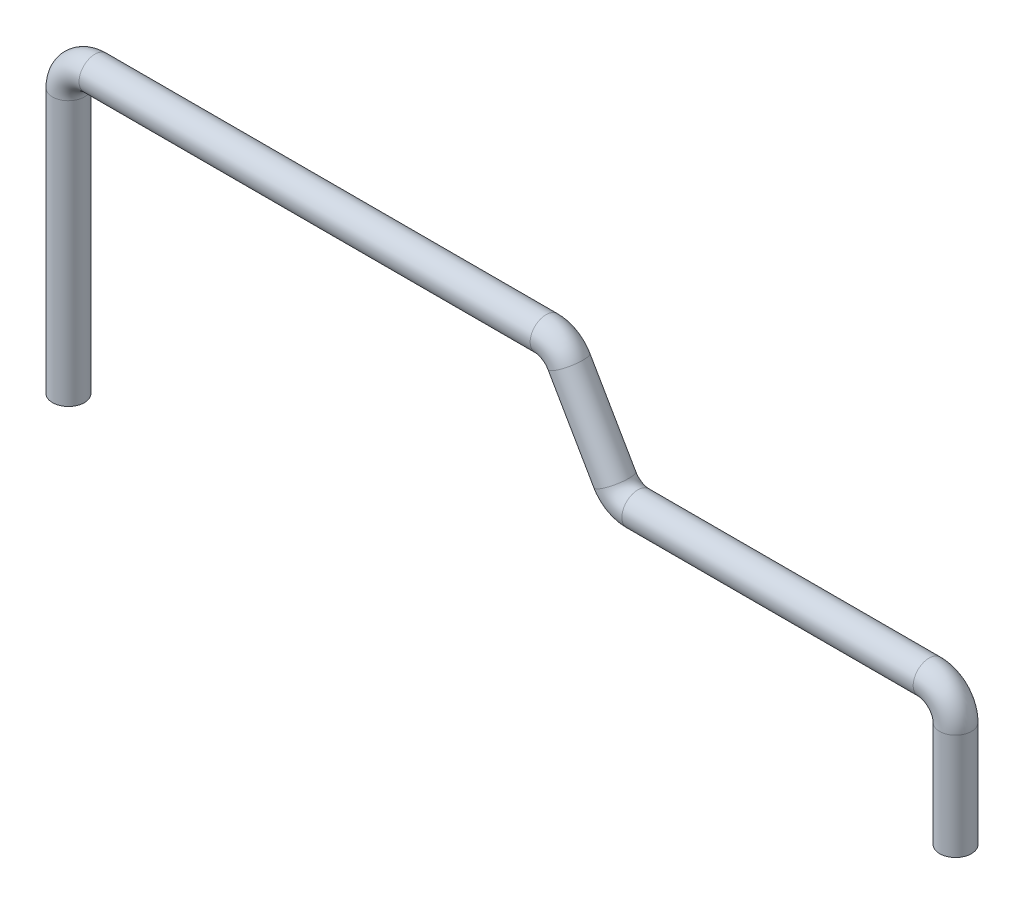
from build123d import *

# Parameters (mm, degrees)
SKETCH2_R = 0.6


with BuildPart() as part:
    # Sweep1: sweep along a path in Sketch1
    with BuildLine(Plane.XY) as sweep1_path:
        Line((0, 0), (0, 10))
        ThreePointArc((0, 10), (0.292893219, 10.707106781), (1, 11))
        Line((1, 11), (18.035898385, 11))
        ThreePointArc((18.035898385, 11), (18.535898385, 10.866025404), (18.901923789, 10.5))
        Line((18.901923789, 10.5), (20.633974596, 7.5))
        ThreePointArc((20.633974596, 7.5), (21, 7.133974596), (21.5, 7))
        Line((21.5, 7), (32.5, 7))
        ThreePointArc((32.5, 7), (33.207106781, 6.707106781), (33.5, 6))
        Line((33.5, 6), (33.5, 2))
    # Sketch2 → Sweep1 (sweep)
    with BuildSketch(Plane(origin=(0, 0, 0), x_dir=(1, 0, 0), z_dir=(0, 1, 0))):
        Circle(SKETCH2_R)
    sweep(path=sweep1_path.line)


solid = part.part
